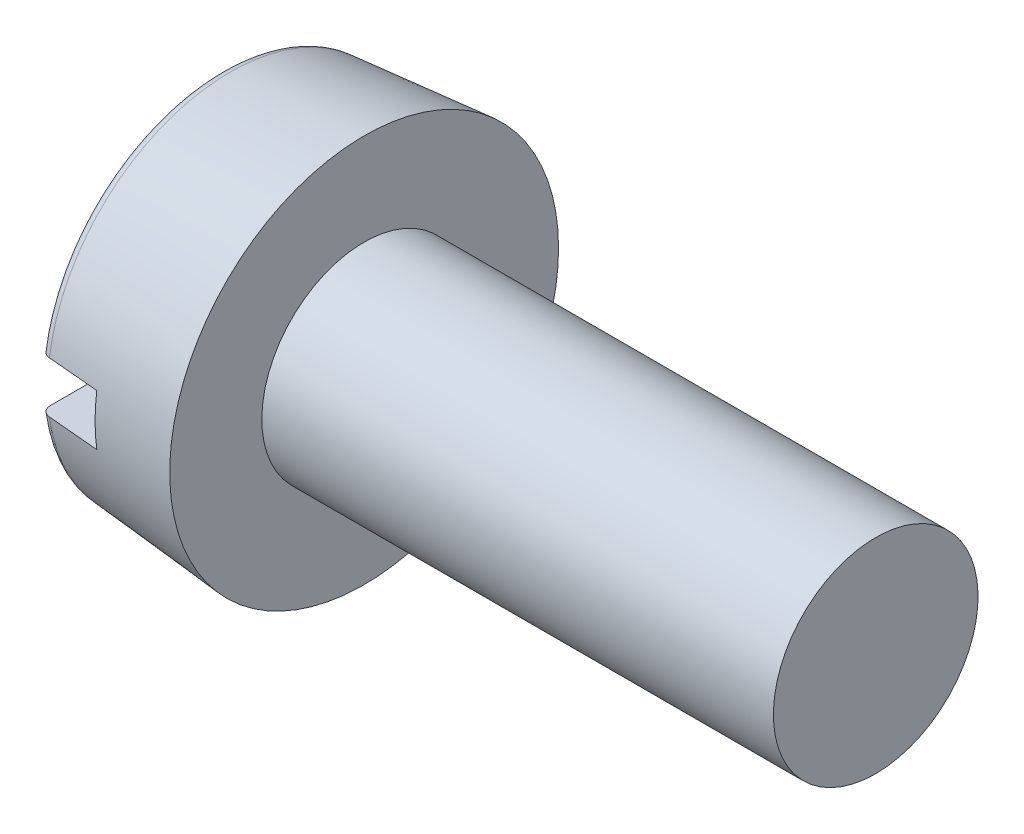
ISO-10303-21;
HEADER;
FILE_DESCRIPTION(('STEP AP214'),'2;1');
FILE_NAME('part.step','',(''),(''),'','','');
FILE_SCHEMA(('AUTOMOTIVE_DESIGN { 1 0 10303 214 1 1 1 1 }'));
ENDSEC;
DATA;
#1=APPLICATION_CONTEXT('core data for automotive mechanical design processes');
#2=APPLICATION_PROTOCOL_DEFINITION('international standard','automotive_design',2000,#1);
#3=PRODUCT_CONTEXT('',#1,'mechanical');
#4=PRODUCT('Part','Part','',(#3));
#5=PRODUCT_RELATED_PRODUCT_CATEGORY('part','',(#4));
#6=PRODUCT_DEFINITION_FORMATION('','',#4);
#7=PRODUCT_DEFINITION_CONTEXT('part definition',#1,'design');
#8=PRODUCT_DEFINITION('design','',#6,#7);
#9=PRODUCT_DEFINITION_SHAPE('','',#8);
#10=(LENGTH_UNIT() NAMED_UNIT(*) SI_UNIT(.MILLI.,.METRE.));
#11=(NAMED_UNIT(*) PLANE_ANGLE_UNIT() SI_UNIT($,.RADIAN.));
#12=(NAMED_UNIT(*) SI_UNIT($,.STERADIAN.) SOLID_ANGLE_UNIT());
#13=UNCERTAINTY_MEASURE_WITH_UNIT(LENGTH_MEASURE(1.E-05),#10,'distance_accuracy_value','');
#14=(GEOMETRIC_REPRESENTATION_CONTEXT(3) GLOBAL_UNCERTAINTY_ASSIGNED_CONTEXT((#13)) GLOBAL_UNIT_ASSIGNED_CONTEXT((#10,
#11,#12)) REPRESENTATION_CONTEXT('',''));
#15=CARTESIAN_POINT('',(0.,0.,0.));
#16=DIRECTION('',(0.,0.,1.));
#17=DIRECTION('',(1.,0.,0.));
#18=AXIS2_PLACEMENT_3D('',#15,#16,#17);
#19=CARTESIAN_POINT('',(0.600000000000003,-0.250000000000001,-1.9));
#20=DIRECTION('',(1.,0.,0.));
#21=DIRECTION('',(0.,1.,0.));
#22=AXIS2_PLACEMENT_3D('',#19,#20,#21);
#23=PLANE('',#22);
#24=CARTESIAN_POINT('',(0.600000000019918,0.,0.));
#25=DIRECTION('',(1.,0.,0.));
#26=DIRECTION('',(0.,0.,-1.));
#27=AXIS2_PLACEMENT_3D('',#24,#25,#26);
#28=CIRCLE('',#27,1.83000906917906);
#29=CARTESIAN_POINT('',(0.600000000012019,0.25,1.81285222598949));
#30=VERTEX_POINT('',#29);
#31=CARTESIAN_POINT('',(0.600000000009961,-0.25,1.81285222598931));
#32=VERTEX_POINT('',#31);
#33=EDGE_CURVE('E76',#30,#32,#28,.T.);
#34=ORIENTED_EDGE('',*,*,#33,.F.);
#35=DIRECTION('',(0.,0.,1.));
#36=VECTOR('',#35,1.);
#37=CARTESIAN_POINT('',(0.599999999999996,0.25,1.9));
#38=LINE('',#37,#36);
#39=CARTESIAN_POINT('',(0.600000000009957,0.249999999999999,-1.81285222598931));
#40=VERTEX_POINT('',#39);
#41=EDGE_CURVE('E74',#30,#40,#38,.F.);
#42=ORIENTED_EDGE('',*,*,#41,.T.);
#43=CARTESIAN_POINT('',(0.600000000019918,0.,0.));
#44=DIRECTION('',(1.,0.,0.));
#45=DIRECTION('',(0.,0.,-1.));
#46=AXIS2_PLACEMENT_3D('',#43,#44,#45);
#47=CIRCLE('',#46,1.83000906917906);
#48=CARTESIAN_POINT('',(0.600000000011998,-0.250000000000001,-1.81285222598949));
#49=VERTEX_POINT('',#48);
#50=EDGE_CURVE('E19',#49,#40,#47,.T.);
#51=ORIENTED_EDGE('',*,*,#50,.F.);
#52=DIRECTION('',(0.,0.,-1.));
#53=VECTOR('',#52,1.);
#54=CARTESIAN_POINT('',(0.600000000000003,-0.250000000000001,-1.9));
#55=LINE('',#54,#53);
#56=EDGE_CURVE('E71',#49,#32,#55,.F.);
#57=ORIENTED_EDGE('',*,*,#56,.T.);
#58=EDGE_LOOP('',(#34,#42,#51,#57));
#59=FACE_BOUND('',#58,.T.);
#60=ADVANCED_FACE('F16',(#59),#23,.F.);
#61=CARTESIAN_POINT('',(0.599999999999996,0.25,1.9));
#62=DIRECTION('',(0.,1.,0.));
#63=DIRECTION('',(0.,0.,1.));
#64=AXIS2_PLACEMENT_3D('',#61,#62,#63);
#65=PLANE('',#64);
#66=ORIENTED_EDGE('',*,*,#41,.F.);
#67=CARTESIAN_POINT('',(0.0912844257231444,0.25,1.76791351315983));
#68=CARTESIAN_POINT('',(0.176070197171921,0.25,1.77540508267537));
#69=CARTESIAN_POINT('',(0.260856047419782,0.25,1.78289576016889));
#70=CARTESIAN_POINT('',(0.43042790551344,0.25,1.79787533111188));
#71=CARTESIAN_POINT('',(0.515213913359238,0.25,1.80536422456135));
#72=CARTESIAN_POINT('',(0.60000000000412,0.25,1.8128522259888));
#73=B_SPLINE_CURVE_WITH_KNOTS('',3,(#67,#68,#69,#70,#71,#72),.UNSPECIFIED.,.F.,.F.,(4,2,4),(0.,
0.255348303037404,0.510696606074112),.UNSPECIFIED.);
#74=CARTESIAN_POINT('',(0.0912844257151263,0.25,1.76791351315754));
#75=VERTEX_POINT('',#74);
#76=EDGE_CURVE('E100',#75,#30,#73,.T.);
#77=ORIENTED_EDGE('',*,*,#76,.F.);
#78=CARTESIAN_POINT('',(0.,0.25,1.66724343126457));
#79=CARTESIAN_POINT('',(7.5069600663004E-07,0.250000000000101,1.6729798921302));
#80=CARTESIAN_POINT('',(0.000484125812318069,0.250000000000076,1.67870615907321));
#81=CARTESIAN_POINT('',(0.00239953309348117,0.249999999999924,1.689995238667));
#82=CARTESIAN_POINT('',(0.00383119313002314,0.249999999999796,1.69555811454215));
#83=CARTESIAN_POINT('',(0.00951236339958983,0.249999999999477,1.71175997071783));
#84=CARTESIAN_POINT('',(0.0151482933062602,0.249999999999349,1.72195004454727));
#85=CARTESIAN_POINT('',(0.0294501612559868,0.24999999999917,1.73979103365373));
#86=CARTESIAN_POINT('',(0.0380989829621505,0.249999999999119,1.74745582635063));
#87=CARTESIAN_POINT('',(0.0574025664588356,0.249999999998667,1.75937320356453));
#88=CARTESIAN_POINT('',(0.0680362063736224,0.249999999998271,1.76365943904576));
#89=CARTESIAN_POINT('',(0.0830786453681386,0.249999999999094,1.76693346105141));
#90=CARTESIAN_POINT('',(0.0871735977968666,0.24999999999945,1.76755783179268));
#91=CARTESIAN_POINT('',(0.0912844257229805,0.25,1.76791351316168));
#92=B_SPLINE_CURVE_WITH_KNOTS('',3,(#78,#79,#80,#81,#82,#83,#84,#85,#86,#87,#88,#89,#90,#91),
.UNSPECIFIED.,.F.,.F.,(4,2,2,2,2,2,4),(0.,0.0171690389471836,0.0343313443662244,
0.0685479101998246,0.102573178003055,0.136255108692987,0.148647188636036),.UNSPECIFIED.);
#93=CARTESIAN_POINT('',(0.,0.249999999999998,1.66724343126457));
#94=VERTEX_POINT('',#93);
#95=EDGE_CURVE('E139',#94,#75,#92,.T.);
#96=ORIENTED_EDGE('',*,*,#95,.F.);
#97=DIRECTION('',(0.,0.,1.));
#98=VECTOR('',#97,1.);
#99=CARTESIAN_POINT('',(0.,0.249999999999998,0.));
#100=LINE('',#99,#98);
#101=CARTESIAN_POINT('',(0.,0.249999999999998,-1.66724343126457));
#102=VERTEX_POINT('',#101);
#103=EDGE_CURVE('E85',#102,#94,#100,.T.);
#104=ORIENTED_EDGE('',*,*,#103,.F.);
#105=CARTESIAN_POINT('',(0.0912844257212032,0.249999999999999,-1.76791351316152));
#106=CARTESIAN_POINT('',(0.0857077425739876,0.250000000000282,-1.76742067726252));
#107=CARTESIAN_POINT('',(0.0801832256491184,0.250000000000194,-1.76645479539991));
#108=CARTESIAN_POINT('',(0.0693799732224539,0.249999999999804,-1.76361231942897));
#109=CARTESIAN_POINT('',(0.0641009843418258,0.249999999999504,-1.76173668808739));
#110=CARTESIAN_POINT('',(0.0488592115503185,0.249999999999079,-1.75480995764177));
#111=CARTESIAN_POINT('',(0.0394539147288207,0.249999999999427,-1.74845538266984));
#112=CARTESIAN_POINT('',(0.0232245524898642,0.249999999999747,-1.73299447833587));
#113=CARTESIAN_POINT('',(0.0164140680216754,0.249999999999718,-1.72387410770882));
#114=CARTESIAN_POINT('',(0.00609300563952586,0.249999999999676,-1.70379048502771));
#115=CARTESIAN_POINT('',(0.00261576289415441,0.249999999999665,-1.69280988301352));
#116=CARTESIAN_POINT('',(0.000332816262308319,0.249999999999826,-1.67684061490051));
#117=CARTESIAN_POINT('',(-9.34856840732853E-06,0.249999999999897,-1.67203694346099));
#118=CARTESIAN_POINT('',(0.,0.249999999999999,-1.66724343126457));
#119=B_SPLINE_CURVE_WITH_KNOTS('',3,(#105,#106,#107,#108,#109,#110,#111,#112,#113,#114,#115,
#116,#117,#118),.UNSPECIFIED.,.F.,.F.,(4,2,2,2,2,2,4),(0.,0.0167551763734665,0.0334926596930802,
0.0668595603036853,0.100398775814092,0.134270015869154,0.148665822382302),.UNSPECIFIED.);
#120=CARTESIAN_POINT('',(0.0912844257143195,0.249999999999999,-1.76791351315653));
#121=VERTEX_POINT('',#120);
#122=EDGE_CURVE('E158',#121,#102,#119,.T.);
#123=ORIENTED_EDGE('',*,*,#122,.F.);
#124=CARTESIAN_POINT('',(0.600000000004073,0.249999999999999,-1.81285222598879));
#125=CARTESIAN_POINT('',(0.515213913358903,0.249999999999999,-1.80536422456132));
#126=CARTESIAN_POINT('',(0.430427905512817,0.249999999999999,-1.79787533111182));
#127=CARTESIAN_POINT('',(0.260856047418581,0.249999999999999,-1.78289576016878));
#128=CARTESIAN_POINT('',(0.176070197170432,0.249999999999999,-1.77540508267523));
#129=CARTESIAN_POINT('',(0.0912844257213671,0.249999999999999,-1.76791351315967));
#130=B_SPLINE_CURVE_WITH_KNOTS('',3,(#124,#125,#126,#127,#128,#129),.UNSPECIFIED.,.F.,.F.,(4,2,
4),(0.,0.255348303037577,0.510696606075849),.UNSPECIFIED.);
#131=EDGE_CURVE('E90',#40,#121,#130,.T.);
#132=ORIENTED_EDGE('',*,*,#131,.F.);
#133=EDGE_LOOP('',(#66,#77,#96,#104,#123,#132));
#134=FACE_BOUND('',#133,.T.);
#135=ADVANCED_FACE('F141',(#134),#65,.F.);
#136=CARTESIAN_POINT('',(0.600000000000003,-0.250000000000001,-1.9));
#137=DIRECTION('',(0.,-1.,0.));
#138=DIRECTION('',(0.,0.,-1.));
#139=AXIS2_PLACEMENT_3D('',#136,#137,#138);
#140=PLANE('',#139);
#141=CARTESIAN_POINT('',(0.,-0.250000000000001,-1.66724343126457));
#142=CARTESIAN_POINT('',(7.50696006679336E-07,-0.250000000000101,-1.6729798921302));
#143=CARTESIAN_POINT('',(0.000484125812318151,-0.250000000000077,-1.67870615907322));
#144=CARTESIAN_POINT('',(0.00239953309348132,-0.249999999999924,-1.689995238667));
#145=CARTESIAN_POINT('',(0.00383119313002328,-0.249999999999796,-1.69555811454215));
#146=CARTESIAN_POINT('',(0.00951236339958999,-0.249999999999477,-1.71175997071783));
#147=CARTESIAN_POINT('',(0.0151482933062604,-0.249999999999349,-1.72195004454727));
#148=CARTESIAN_POINT('',(0.0294501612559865,-0.249999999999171,-1.73979103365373));
#149=CARTESIAN_POINT('',(0.0380989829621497,-0.24999999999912,-1.74745582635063));
#150=CARTESIAN_POINT('',(0.057402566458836,-0.249999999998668,-1.75937320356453));
#151=CARTESIAN_POINT('',(0.0680362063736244,-0.249999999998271,-1.76365943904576));
#152=CARTESIAN_POINT('',(0.0830786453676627,-0.249999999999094,-1.7669334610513));
#153=CARTESIAN_POINT('',(0.0871735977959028,-0.24999999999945,-1.76755783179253));
#154=CARTESIAN_POINT('',(0.0912844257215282,-0.25,-1.76791351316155));
#155=B_SPLINE_CURVE_WITH_KNOTS('',3,(#141,#142,#143,#144,#145,#146,#147,#148,#149,#150,#151,
#152,#153,#154),.UNSPECIFIED.,.F.,.F.,(4,2,2,2,2,2,4),(0.,0.0171690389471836,0.0343313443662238,
0.0685479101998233,0.102573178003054,0.136255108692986,0.148647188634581),.UNSPECIFIED.);
#156=CARTESIAN_POINT('',(0.,-0.25,-1.66724343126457));
#157=VERTEX_POINT('',#156);
#158=CARTESIAN_POINT('',(0.0912844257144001,-0.250000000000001,-1.76791351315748));
#159=VERTEX_POINT('',#158);
#160=EDGE_CURVE('E86',#157,#159,#155,.T.);
#161=ORIENTED_EDGE('',*,*,#160,.F.);
#162=DIRECTION('',(0.,0.,1.));
#163=VECTOR('',#162,1.);
#164=CARTESIAN_POINT('',(0.,-0.25,0.));
#165=LINE('',#164,#163);
#166=CARTESIAN_POINT('',(0.,-0.25,1.66724343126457));
#167=VERTEX_POINT('',#166);
#168=EDGE_CURVE('E183',#167,#157,#165,.F.);
#169=ORIENTED_EDGE('',*,*,#168,.F.);
#170=CARTESIAN_POINT('',(0.0912844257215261,-0.249999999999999,1.76791351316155));
#171=CARTESIAN_POINT('',(0.0857077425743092,-0.250000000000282,1.76742067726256));
#172=CARTESIAN_POINT('',(0.0801832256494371,-0.250000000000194,1.76645479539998));
#173=CARTESIAN_POINT('',(0.069379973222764,-0.249999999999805,1.76361231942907));
#174=CARTESIAN_POINT('',(0.0641009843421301,-0.249999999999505,1.76173668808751));
#175=CARTESIAN_POINT('',(0.0488592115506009,-0.249999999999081,1.75480995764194));
#176=CARTESIAN_POINT('',(0.0394539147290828,-0.249999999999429,1.74845538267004));
#177=CARTESIAN_POINT('',(0.0232245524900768,-0.249999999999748,1.73299447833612));
#178=CARTESIAN_POINT('',(0.0164140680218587,-0.249999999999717,1.72387410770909));
#179=CARTESIAN_POINT('',(0.0060930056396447,-0.249999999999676,1.70379048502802));
#180=CARTESIAN_POINT('',(0.00261576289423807,-0.249999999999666,1.69280988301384));
#181=CARTESIAN_POINT('',(0.000332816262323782,-0.249999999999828,1.67684061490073));
#182=CARTESIAN_POINT('',(-9.34856840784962E-06,-0.249999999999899,1.6720369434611));
#183=CARTESIAN_POINT('',(0.,-0.25,1.66724343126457));
#184=B_SPLINE_CURVE_WITH_KNOTS('',3,(#170,#171,#172,#173,#174,#175,#176,#177,#178,#179,#180,
#181,#182,#183),.UNSPECIFIED.,.F.,.F.,(4,2,2,2,2,2,4),(0.,0.0167551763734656,0.0334926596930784,
0.0668595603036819,0.100398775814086,0.134270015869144,0.148665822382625),.UNSPECIFIED.);
#185=CARTESIAN_POINT('',(0.091284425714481,-0.25,1.76791351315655));
#186=VERTEX_POINT('',#185);
#187=EDGE_CURVE('E34',#186,#167,#184,.T.);
#188=ORIENTED_EDGE('',*,*,#187,.F.);
#189=CARTESIAN_POINT('',(0.600000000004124,-0.25,1.8128522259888));
#190=CARTESIAN_POINT('',(0.515213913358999,-0.25,1.80536422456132));
#191=CARTESIAN_POINT('',(0.430427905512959,-0.25,1.79787533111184));
#192=CARTESIAN_POINT('',(0.260856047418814,-0.25,1.7828957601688));
#193=CARTESIAN_POINT('',(0.17607019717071,-0.25,1.77540508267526));
#194=CARTESIAN_POINT('',(0.0912844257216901,-0.25,1.7679135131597));
#195=B_SPLINE_CURVE_WITH_KNOTS('',3,(#189,#190,#191,#192,#193,#194),.UNSPECIFIED.,.F.,.F.,(4,2,
4),(0.,0.25534830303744,0.510696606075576),.UNSPECIFIED.);
#196=EDGE_CURVE('E89',#32,#186,#195,.T.);
#197=ORIENTED_EDGE('',*,*,#196,.F.);
#198=ORIENTED_EDGE('',*,*,#56,.F.);
#199=CARTESIAN_POINT('',(0.0912844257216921,-0.250000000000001,-1.7679135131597));
#200=CARTESIAN_POINT('',(0.176070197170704,-0.250000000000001,-1.77540508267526));
#201=CARTESIAN_POINT('',(0.260856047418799,-0.250000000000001,-1.7828957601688));
#202=CARTESIAN_POINT('',(0.430427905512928,-0.250000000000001,-1.79787533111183));
#203=CARTESIAN_POINT('',(0.515213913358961,-0.250000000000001,-1.80536422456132));
#204=CARTESIAN_POINT('',(0.600000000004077,-0.250000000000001,-1.81285222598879));
#205=B_SPLINE_CURVE_WITH_KNOTS('',3,(#199,#200,#201,#202,#203,#204),.UNSPECIFIED.,.F.,.F.,(4,2,
4),(0.,0.255348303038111,0.510696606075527),.UNSPECIFIED.);
#206=EDGE_CURVE('E79',#159,#49,#205,.T.);
#207=ORIENTED_EDGE('',*,*,#206,.F.);
#208=EDGE_LOOP('',(#161,#169,#188,#197,#198,#207));
#209=FACE_BOUND('',#208,.T.);
#210=ADVANCED_FACE('F88',(#209),#140,.F.);
#211=CARTESIAN_POINT('',(0.,0.,0.));
#212=DIRECTION('',(-1.,0.,0.));
#213=DIRECTION('',(0.,-1.,0.));
#214=AXIS2_PLACEMENT_3D('',#211,#212,#213);
#215=PLANE('',#214);
#216=ORIENTED_EDGE('',*,*,#103,.T.);
#217=CARTESIAN_POINT('',(0.,0.,0.));
#218=DIRECTION('',(1.,0.,0.));
#219=DIRECTION('',(0.,0.148290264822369,-0.988943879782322));
#220=AXIS2_PLACEMENT_3D('',#217,#218,#219);
#221=CIRCLE('',#220,1.68588275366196);
#222=EDGE_CURVE('E190',#102,#94,#221,.T.);
#223=ORIENTED_EDGE('',*,*,#222,.F.);
#224=EDGE_LOOP('',(#216,#223));
#225=FACE_BOUND('',#224,.T.);
#226=ADVANCED_FACE('F211',(#225),#215,.T.);
#227=CARTESIAN_POINT('',(0.,0.,0.));
#228=DIRECTION('',(-1.,0.,0.));
#229=DIRECTION('',(0.,-1.,0.));
#230=AXIS2_PLACEMENT_3D('',#227,#228,#229);
#231=PLANE('',#230);
#232=ORIENTED_EDGE('',*,*,#168,.T.);
#233=CARTESIAN_POINT('',(0.,0.,0.));
#234=DIRECTION('',(1.,0.,0.));
#235=DIRECTION('',(0.,-0.14829026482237,0.988943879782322));
#236=AXIS2_PLACEMENT_3D('',#233,#234,#235);
#237=CIRCLE('',#236,1.68588275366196);
#238=EDGE_CURVE('E175',#167,#157,#237,.T.);
#239=ORIENTED_EDGE('',*,*,#238,.F.);
#240=EDGE_LOOP('',(#232,#239));
#241=FACE_BOUND('',#240,.T.);
#242=ADVANCED_FACE('F164',(#241),#231,.T.);
#243=CARTESIAN_POINT('',(0.100000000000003,0.,0.));
#244=DIRECTION('',(-1.,0.,0.));
#245=DIRECTION('',(0.,0.,1.));
#246=AXIS2_PLACEMENT_3D('',#243,#244,#245);
#247=TOROIDAL_SURFACE('',#246,1.68588275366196,0.1);
#248=ORIENTED_EDGE('',*,*,#95,.T.);
#249=CARTESIAN_POINT('',(0.091284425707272,0.,0.));
#250=DIRECTION('',(1.,0.,0.));
#251=DIRECTION('',(0.,0.,-1.));
#252=AXIS2_PLACEMENT_3D('',#249,#250,#251);
#253=CIRCLE('',#252,1.78550222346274);
#254=EDGE_CURVE('E172',#121,#75,#253,.T.);
#255=ORIENTED_EDGE('',*,*,#254,.F.);
#256=ORIENTED_EDGE('',*,*,#122,.T.);
#257=ORIENTED_EDGE('',*,*,#222,.T.);
#258=EDGE_LOOP('',(#248,#255,#256,#257));
#259=FACE_BOUND('',#258,.T.);
#260=ADVANCED_FACE('F159',(#259),#247,.T.);
#261=CARTESIAN_POINT('',(0.100000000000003,0.,0.));
#262=DIRECTION('',(-1.,0.,0.));
#263=DIRECTION('',(0.,0.,1.));
#264=AXIS2_PLACEMENT_3D('',#261,#262,#263);
#265=TOROIDAL_SURFACE('',#264,1.68588275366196,0.1);
#266=ORIENTED_EDGE('',*,*,#187,.T.);
#267=ORIENTED_EDGE('',*,*,#238,.T.);
#268=ORIENTED_EDGE('',*,*,#160,.T.);
#269=CARTESIAN_POINT('',(0.091284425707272,0.,0.));
#270=DIRECTION('',(1.,0.,0.));
#271=DIRECTION('',(0.,0.,-1.));
#272=AXIS2_PLACEMENT_3D('',#269,#270,#271);
#273=CIRCLE('',#272,1.78550222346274);
#274=EDGE_CURVE('E83',#186,#159,#273,.T.);
#275=ORIENTED_EDGE('',*,*,#274,.F.);
#276=EDGE_LOOP('',(#266,#267,#268,#275));
#277=FACE_BOUND('',#276,.T.);
#278=ADVANCED_FACE('F120',(#277),#265,.T.);
#279=CARTESIAN_POINT('',(1.39999999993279,0.,0.));
#280=DIRECTION('',(1.,0.,0.));
#281=DIRECTION('',(0.,0.,-1.));
#282=AXIS2_PLACEMENT_3D('',#279,#280,#281);
#283=CONICAL_SURFACE('',#282,1.89999999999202,0.0872664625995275);
#284=ORIENTED_EDGE('',*,*,#76,.T.);
#285=ORIENTED_EDGE('',*,*,#33,.T.);
#286=ORIENTED_EDGE('',*,*,#196,.T.);
#287=ORIENTED_EDGE('',*,*,#274,.T.);
#288=ORIENTED_EDGE('',*,*,#206,.T.);
#289=ORIENTED_EDGE('',*,*,#50,.T.);
#290=ORIENTED_EDGE('',*,*,#131,.T.);
#291=ORIENTED_EDGE('',*,*,#254,.T.);
#292=EDGE_LOOP('',(#284,#285,#286,#287,#288,#289,#290,#291));
#293=FACE_BOUND('',#292,.T.);
#294=CARTESIAN_POINT('',(1.39999999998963,0.,0.));
#295=DIRECTION('',(1.,0.,0.));
#296=DIRECTION('',(0.,0.,-1.));
#297=AXIS2_PLACEMENT_3D('',#294,#295,#296);
#298=CIRCLE('',#297,1.89999999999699);
#299=CARTESIAN_POINT('',(1.39999999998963,0.,-1.89999999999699));
#300=VERTEX_POINT('',#299);
#301=EDGE_CURVE('E104',#300,#300,#298,.F.);
#302=ORIENTED_EDGE('',*,*,#301,.T.);
#303=EDGE_LOOP('',(#302));
#304=FACE_BOUND('',#303,.T.);
#305=ADVANCED_FACE('F81',(#293,#304),#283,.T.);
#306=CARTESIAN_POINT('',(6.4,0.999999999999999,0.));
#307=DIRECTION('',(1.,0.,0.));
#308=DIRECTION('',(0.,1.,0.));
#309=AXIS2_PLACEMENT_3D('',#306,#307,#308);
#310=PLANE('',#309);
#311=CARTESIAN_POINT('',(6.4,0.,0.));
#312=DIRECTION('',(-1.,0.,0.));
#313=DIRECTION('',(0.,-1.,0.));
#314=AXIS2_PLACEMENT_3D('',#311,#312,#313);
#315=CIRCLE('',#314,1.);
#316=CARTESIAN_POINT('',(6.4,-1.,0.));
#317=VERTEX_POINT('',#316);
#318=EDGE_CURVE('E25',#317,#317,#315,.T.);
#319=ORIENTED_EDGE('',*,*,#318,.F.);
#320=EDGE_LOOP('',(#319));
#321=FACE_BOUND('',#320,.T.);
#322=ADVANCED_FACE('F119',(#321),#310,.T.);
#323=CARTESIAN_POINT('',(1.4,1.,0.));
#324=DIRECTION('',(-1.,0.,0.));
#325=DIRECTION('',(0.,-1.,0.));
#326=AXIS2_PLACEMENT_3D('',#323,#324,#325);
#327=PLANE('',#326);
#328=CARTESIAN_POINT('',(1.4,0.,0.));
#329=DIRECTION('',(-1.,0.,0.));
#330=DIRECTION('',(0.,-1.,0.));
#331=AXIS2_PLACEMENT_3D('',#328,#329,#330);
#332=CIRCLE('',#331,1.);
#333=CARTESIAN_POINT('',(1.4,-1.,0.));
#334=VERTEX_POINT('',#333);
#335=EDGE_CURVE('E11',#334,#334,#332,.F.);
#336=ORIENTED_EDGE('',*,*,#335,.F.);
#337=EDGE_LOOP('',(#336));
#338=FACE_BOUND('',#337,.T.);
#339=ORIENTED_EDGE('',*,*,#301,.F.);
#340=EDGE_LOOP('',(#339));
#341=FACE_BOUND('',#340,.T.);
#342=ADVANCED_FACE('F226',(#338,#341),#327,.F.);
#343=CARTESIAN_POINT('',(-25.4,0.,0.));
#344=DIRECTION('',(-1.,0.,0.));
#345=DIRECTION('',(0.,-1.,0.));
#346=AXIS2_PLACEMENT_3D('',#343,#344,#345);
#347=CYLINDRICAL_SURFACE('',#346,1.);
#348=ORIENTED_EDGE('',*,*,#318,.T.);
#349=EDGE_LOOP('',(#348));
#350=FACE_BOUND('',#349,.T.);
#351=ORIENTED_EDGE('',*,*,#335,.T.);
#352=EDGE_LOOP('',(#351));
#353=FACE_BOUND('',#352,.T.);
#354=ADVANCED_FACE('F224',(#350,#353),#347,.T.);
#355=CLOSED_SHELL('',(#60,#135,#210,#226,#242,#260,#278,#305,#322,#342,#354));
#356=MANIFOLD_SOLID_BREP('B1',#355);
#357=ADVANCED_BREP_SHAPE_REPRESENTATION('',(#18,#356),#14);
#358=SHAPE_DEFINITION_REPRESENTATION(#9,#357);
ENDSEC;
END-ISO-10303-21;
